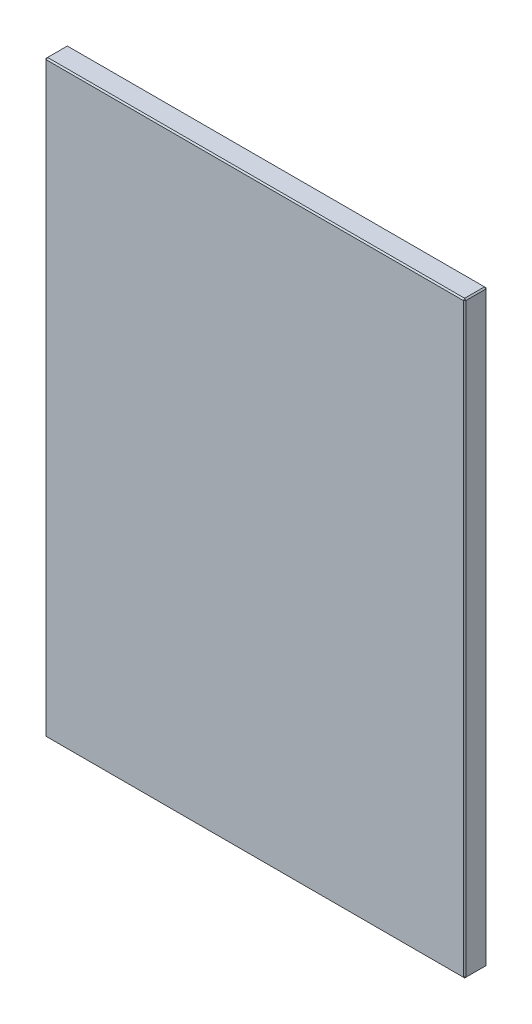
ISO-10303-21;
HEADER;
FILE_DESCRIPTION(('STEP AP214'),'2;1');
FILE_NAME('part.step','',(''),(''),'','','');
FILE_SCHEMA(('AUTOMOTIVE_DESIGN { 1 0 10303 214 1 1 1 1 }'));
ENDSEC;
DATA;
#1=APPLICATION_CONTEXT('core data for automotive mechanical design processes');
#2=APPLICATION_PROTOCOL_DEFINITION('international standard','automotive_design',2000,#1);
#3=PRODUCT_CONTEXT('',#1,'mechanical');
#4=PRODUCT('Part','Part','',(#3));
#5=PRODUCT_RELATED_PRODUCT_CATEGORY('part','',(#4));
#6=PRODUCT_DEFINITION_FORMATION('','',#4);
#7=PRODUCT_DEFINITION_CONTEXT('part definition',#1,'design');
#8=PRODUCT_DEFINITION('design','',#6,#7);
#9=PRODUCT_DEFINITION_SHAPE('','',#8);
#10=(LENGTH_UNIT() NAMED_UNIT(*) SI_UNIT(.MILLI.,.METRE.));
#11=(NAMED_UNIT(*) PLANE_ANGLE_UNIT() SI_UNIT($,.RADIAN.));
#12=(NAMED_UNIT(*) SI_UNIT($,.STERADIAN.) SOLID_ANGLE_UNIT());
#13=UNCERTAINTY_MEASURE_WITH_UNIT(LENGTH_MEASURE(1.E-05),#10,'distance_accuracy_value','');
#14=(GEOMETRIC_REPRESENTATION_CONTEXT(3) GLOBAL_UNCERTAINTY_ASSIGNED_CONTEXT((#13)) GLOBAL_UNIT_ASSIGNED_CONTEXT((#10,
#11,#12)) REPRESENTATION_CONTEXT('',''));
#15=CARTESIAN_POINT('',(0.,0.,0.));
#16=DIRECTION('',(0.,0.,1.));
#17=DIRECTION('',(1.,0.,0.));
#18=AXIS2_PLACEMENT_3D('',#15,#16,#17);
#19=CARTESIAN_POINT('',(-159.,-223.,17.));
#20=DIRECTION('',(1.,0.,0.));
#21=DIRECTION('',(0.,0.,-1.));
#22=AXIS2_PLACEMENT_3D('',#19,#20,#21);
#23=PLANE('',#22);
#24=DIRECTION('',(0.,0.,-1.));
#25=VECTOR('',#24,1.);
#26=CARTESIAN_POINT('',(-159.,222.,17.));
#27=LINE('',#26,#25);
#28=CARTESIAN_POINT('',(-159.,222.,16.));
#29=VERTEX_POINT('',#28);
#30=CARTESIAN_POINT('',(-159.,222.,1.));
#31=VERTEX_POINT('',#30);
#32=EDGE_CURVE('E114',#29,#31,#27,.T.);
#33=ORIENTED_EDGE('',*,*,#32,.T.);
#34=DIRECTION('',(0.,-1.,0.));
#35=VECTOR('',#34,1.);
#36=CARTESIAN_POINT('',(-159.,-223.,1.));
#37=LINE('',#36,#35);
#38=CARTESIAN_POINT('',(-159.,-222.,1.));
#39=VERTEX_POINT('',#38);
#40=EDGE_CURVE('E110',#31,#39,#37,.T.);
#41=ORIENTED_EDGE('',*,*,#40,.T.);
#42=DIRECTION('',(0.,0.,1.));
#43=VECTOR('',#42,1.);
#44=CARTESIAN_POINT('',(-159.,-222.,17.));
#45=LINE('',#44,#43);
#46=CARTESIAN_POINT('',(-159.,-222.,16.));
#47=VERTEX_POINT('',#46);
#48=EDGE_CURVE('E103',#39,#47,#45,.T.);
#49=ORIENTED_EDGE('',*,*,#48,.T.);
#50=DIRECTION('',(0.,1.,0.));
#51=VECTOR('',#50,1.);
#52=CARTESIAN_POINT('',(-159.,223.,16.));
#53=LINE('',#52,#51);
#54=EDGE_CURVE('E107',#47,#29,#53,.T.);
#55=ORIENTED_EDGE('',*,*,#54,.T.);
#56=EDGE_LOOP('',(#33,#41,#49,#55));
#57=FACE_BOUND('',#56,.T.);
#58=ADVANCED_FACE('F15',(#57),#23,.F.);
#59=CARTESIAN_POINT('',(159.,-223.,17.));
#60=DIRECTION('',(0.,1.,0.));
#61=DIRECTION('',(-1.,0.,0.));
#62=AXIS2_PLACEMENT_3D('',#59,#60,#61);
#63=PLANE('',#62);
#64=DIRECTION('',(0.,0.,-1.));
#65=VECTOR('',#64,1.);
#66=CARTESIAN_POINT('',(-158.,-223.,17.));
#67=LINE('',#66,#65);
#68=CARTESIAN_POINT('',(-158.,-223.,16.));
#69=VERTEX_POINT('',#68);
#70=CARTESIAN_POINT('',(-158.,-223.,1.00000000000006));
#71=VERTEX_POINT('',#70);
#72=EDGE_CURVE('E122',#69,#71,#67,.T.);
#73=ORIENTED_EDGE('',*,*,#72,.T.);
#74=DIRECTION('',(1.,0.,0.));
#75=VECTOR('',#74,1.);
#76=CARTESIAN_POINT('',(159.,-223.,1.00000000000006));
#77=LINE('',#76,#75);
#78=CARTESIAN_POINT('',(158.,-223.,1.00000000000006));
#79=VERTEX_POINT('',#78);
#80=EDGE_CURVE('E160',#71,#79,#77,.T.);
#81=ORIENTED_EDGE('',*,*,#80,.T.);
#82=DIRECTION('',(0.,0.,1.));
#83=VECTOR('',#82,1.);
#84=CARTESIAN_POINT('',(158.,-223.,17.));
#85=LINE('',#84,#83);
#86=CARTESIAN_POINT('',(158.,-223.,16.));
#87=VERTEX_POINT('',#86);
#88=EDGE_CURVE('E157',#79,#87,#85,.T.);
#89=ORIENTED_EDGE('',*,*,#88,.T.);
#90=DIRECTION('',(-1.,0.,0.));
#91=VECTOR('',#90,1.);
#92=CARTESIAN_POINT('',(-159.,-223.,16.));
#93=LINE('',#92,#91);
#94=EDGE_CURVE('E155',#87,#69,#93,.T.);
#95=ORIENTED_EDGE('',*,*,#94,.T.);
#96=EDGE_LOOP('',(#73,#81,#89,#95));
#97=FACE_BOUND('',#96,.T.);
#98=ADVANCED_FACE('F277',(#97),#63,.F.);
#99=CARTESIAN_POINT('',(159.,-223.,17.));
#100=DIRECTION('',(-1.,0.,0.));
#101=DIRECTION('',(0.,0.,1.));
#102=AXIS2_PLACEMENT_3D('',#99,#100,#101);
#103=PLANE('',#102);
#104=DIRECTION('',(0.,-1.,0.));
#105=VECTOR('',#104,1.);
#106=CARTESIAN_POINT('',(159.,-223.,16.));
#107=LINE('',#106,#105);
#108=CARTESIAN_POINT('',(159.,222.,16.));
#109=VERTEX_POINT('',#108);
#110=CARTESIAN_POINT('',(159.,-222.,16.));
#111=VERTEX_POINT('',#110);
#112=EDGE_CURVE('E162',#109,#111,#107,.T.);
#113=ORIENTED_EDGE('',*,*,#112,.T.);
#114=DIRECTION('',(0.,0.,-1.));
#115=VECTOR('',#114,1.);
#116=CARTESIAN_POINT('',(159.,-222.,17.));
#117=LINE('',#116,#115);
#118=CARTESIAN_POINT('',(159.,-222.,1.00000000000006));
#119=VERTEX_POINT('',#118);
#120=EDGE_CURVE('E168',#111,#119,#117,.T.);
#121=ORIENTED_EDGE('',*,*,#120,.T.);
#122=DIRECTION('',(0.,1.,0.));
#123=VECTOR('',#122,1.);
#124=CARTESIAN_POINT('',(159.,-223.,1.00000000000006));
#125=LINE('',#124,#123);
#126=CARTESIAN_POINT('',(159.,222.,1.00000000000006));
#127=VERTEX_POINT('',#126);
#128=EDGE_CURVE('E166',#119,#127,#125,.T.);
#129=ORIENTED_EDGE('',*,*,#128,.T.);
#130=DIRECTION('',(0.,0.,1.));
#131=VECTOR('',#130,1.);
#132=CARTESIAN_POINT('',(159.,222.,17.));
#133=LINE('',#132,#131);
#134=EDGE_CURVE('E164',#127,#109,#133,.T.);
#135=ORIENTED_EDGE('',*,*,#134,.T.);
#136=EDGE_LOOP('',(#113,#121,#129,#135));
#137=FACE_BOUND('',#136,.T.);
#138=ADVANCED_FACE('F254',(#137),#103,.F.);
#139=CARTESIAN_POINT('',(159.,223.,17.));
#140=DIRECTION('',(0.,-1.,0.));
#141=DIRECTION('',(1.,0.,0.));
#142=AXIS2_PLACEMENT_3D('',#139,#140,#141);
#143=PLANE('',#142);
#144=DIRECTION('',(-1.,0.,0.));
#145=VECTOR('',#144,1.);
#146=CARTESIAN_POINT('',(159.,223.,1.00000000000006));
#147=LINE('',#146,#145);
#148=CARTESIAN_POINT('',(158.,223.,1.00000000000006));
#149=VERTEX_POINT('',#148);
#150=CARTESIAN_POINT('',(-158.,223.,1.00000000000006));
#151=VERTEX_POINT('',#150);
#152=EDGE_CURVE('E150',#149,#151,#147,.T.);
#153=ORIENTED_EDGE('',*,*,#152,.T.);
#154=DIRECTION('',(0.,0.,1.));
#155=VECTOR('',#154,1.);
#156=CARTESIAN_POINT('',(-158.,223.,17.));
#157=LINE('',#156,#155);
#158=CARTESIAN_POINT('',(-158.,223.,16.));
#159=VERTEX_POINT('',#158);
#160=EDGE_CURVE('E152',#151,#159,#157,.T.);
#161=ORIENTED_EDGE('',*,*,#160,.T.);
#162=DIRECTION('',(1.,0.,0.));
#163=VECTOR('',#162,1.);
#164=CARTESIAN_POINT('',(159.,223.,16.));
#165=LINE('',#164,#163);
#166=CARTESIAN_POINT('',(158.,223.,16.));
#167=VERTEX_POINT('',#166);
#168=EDGE_CURVE('E146',#159,#167,#165,.T.);
#169=ORIENTED_EDGE('',*,*,#168,.T.);
#170=DIRECTION('',(0.,0.,-1.));
#171=VECTOR('',#170,1.);
#172=CARTESIAN_POINT('',(158.,223.,17.));
#173=LINE('',#172,#171);
#174=EDGE_CURVE('E148',#167,#149,#173,.T.);
#175=ORIENTED_EDGE('',*,*,#174,.T.);
#176=EDGE_LOOP('',(#153,#161,#169,#175));
#177=FACE_BOUND('',#176,.T.);
#178=ADVANCED_FACE('F286',(#177),#143,.F.);
#179=CARTESIAN_POINT('',(0.,0.,17.));
#180=DIRECTION('',(0.,0.,1.));
#181=DIRECTION('',(1.,0.,0.));
#182=AXIS2_PLACEMENT_3D('',#179,#180,#181);
#183=PLANE('',#182);
#184=DIRECTION('',(0.,1.,0.));
#185=VECTOR('',#184,1.);
#186=CARTESIAN_POINT('',(158.,223.,17.));
#187=LINE('',#186,#185);
#188=CARTESIAN_POINT('',(158.,-222.,17.));
#189=VERTEX_POINT('',#188);
#190=CARTESIAN_POINT('',(158.,222.,17.));
#191=VERTEX_POINT('',#190);
#192=EDGE_CURVE('E24',#189,#191,#187,.T.);
#193=ORIENTED_EDGE('',*,*,#192,.T.);
#194=DIRECTION('',(-1.,0.,0.));
#195=VECTOR('',#194,1.);
#196=CARTESIAN_POINT('',(-159.,222.,17.));
#197=LINE('',#196,#195);
#198=CARTESIAN_POINT('',(-158.,222.,17.));
#199=VERTEX_POINT('',#198);
#200=EDGE_CURVE('E9',#191,#199,#197,.T.);
#201=ORIENTED_EDGE('',*,*,#200,.T.);
#202=DIRECTION('',(0.,-1.,0.));
#203=VECTOR('',#202,1.);
#204=CARTESIAN_POINT('',(-158.,-223.,17.));
#205=LINE('',#204,#203);
#206=CARTESIAN_POINT('',(-158.,-222.,17.));
#207=VERTEX_POINT('',#206);
#208=EDGE_CURVE('E180',#199,#207,#205,.T.);
#209=ORIENTED_EDGE('',*,*,#208,.T.);
#210=DIRECTION('',(1.,0.,0.));
#211=VECTOR('',#210,1.);
#212=CARTESIAN_POINT('',(159.,-222.,17.));
#213=LINE('',#212,#211);
#214=EDGE_CURVE('E35',#207,#189,#213,.T.);
#215=ORIENTED_EDGE('',*,*,#214,.T.);
#216=EDGE_LOOP('',(#193,#201,#209,#215));
#217=FACE_BOUND('',#216,.T.);
#218=ADVANCED_FACE('F351',(#217),#183,.T.);
#219=CARTESIAN_POINT('',(0.,0.,0.));
#220=DIRECTION('',(0.,0.,1.));
#221=DIRECTION('',(1.,0.,0.));
#222=AXIS2_PLACEMENT_3D('',#219,#220,#221);
#223=PLANE('',#222);
#224=DIRECTION('',(0.,-1.,0.));
#225=VECTOR('',#224,1.);
#226=CARTESIAN_POINT('',(158.,0.,0.));
#227=LINE('',#226,#225);
#228=CARTESIAN_POINT('',(158.,222.,0.));
#229=VERTEX_POINT('',#228);
#230=CARTESIAN_POINT('',(158.,-222.,0.));
#231=VERTEX_POINT('',#230);
#232=EDGE_CURVE('E175',#229,#231,#227,.T.);
#233=ORIENTED_EDGE('',*,*,#232,.T.);
#234=DIRECTION('',(-1.,0.,0.));
#235=VECTOR('',#234,1.);
#236=CARTESIAN_POINT('',(0.,-222.,0.));
#237=LINE('',#236,#235);
#238=CARTESIAN_POINT('',(-158.,-222.,0.));
#239=VERTEX_POINT('',#238);
#240=EDGE_CURVE('E177',#231,#239,#237,.T.);
#241=ORIENTED_EDGE('',*,*,#240,.T.);
#242=DIRECTION('',(0.,1.,0.));
#243=VECTOR('',#242,1.);
#244=CARTESIAN_POINT('',(-158.,0.,0.));
#245=LINE('',#244,#243);
#246=CARTESIAN_POINT('',(-158.,222.,0.));
#247=VERTEX_POINT('',#246);
#248=EDGE_CURVE('E173',#239,#247,#245,.T.);
#249=ORIENTED_EDGE('',*,*,#248,.T.);
#250=DIRECTION('',(1.,0.,0.));
#251=VECTOR('',#250,1.);
#252=CARTESIAN_POINT('',(0.,222.,0.));
#253=LINE('',#252,#251);
#254=EDGE_CURVE('E171',#247,#229,#253,.T.);
#255=ORIENTED_EDGE('',*,*,#254,.T.);
#256=EDGE_LOOP('',(#233,#241,#249,#255));
#257=FACE_BOUND('',#256,.T.);
#258=ADVANCED_FACE('F246',(#257),#223,.F.);
#259=CARTESIAN_POINT('',(159.,-222.,17.));
#260=DIRECTION('',(-0.707106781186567,0.707106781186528,0.));
#261=DIRECTION('',(0.,0.,-1.));
#262=AXIS2_PLACEMENT_3D('',#259,#260,#261);
#263=PLANE('',#262);
#264=DIRECTION('',(-0.707106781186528,-0.707106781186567,0.));
#265=VECTOR('',#264,1.);
#266=CARTESIAN_POINT('',(158.,-223.,16.));
#267=LINE('',#266,#265);
#268=EDGE_CURVE('E19',#87,#111,#267,.F.);
#269=ORIENTED_EDGE('',*,*,#268,.F.);
#270=ORIENTED_EDGE('',*,*,#88,.F.);
#271=DIRECTION('',(0.707106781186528,0.707106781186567,0.));
#272=VECTOR('',#271,1.);
#273=CARTESIAN_POINT('',(159.,-222.,1.00000000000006));
#274=LINE('',#273,#272);
#275=EDGE_CURVE('E142',#119,#79,#274,.F.);
#276=ORIENTED_EDGE('',*,*,#275,.F.);
#277=ORIENTED_EDGE('',*,*,#120,.F.);
#278=EDGE_LOOP('',(#269,#270,#276,#277));
#279=FACE_BOUND('',#278,.T.);
#280=ADVANCED_FACE('F17',(#279),#263,.F.);
#281=CARTESIAN_POINT('',(158.,-223.,16.));
#282=DIRECTION('',(0.577350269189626,-0.577350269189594,0.577350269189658));
#283=DIRECTION('',(0.707106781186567,0.,-0.707106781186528));
#284=AXIS2_PLACEMENT_3D('',#281,#282,#283);
#285=PLANE('',#284);
#286=DIRECTION('',(0.,-0.707106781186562,-0.707106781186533));
#287=VECTOR('',#286,1.);
#288=CARTESIAN_POINT('',(158.,-223.,16.));
#289=LINE('',#288,#287);
#290=EDGE_CURVE('E227',#87,#189,#289,.F.);
#291=ORIENTED_EDGE('',*,*,#290,.F.);
#292=ORIENTED_EDGE('',*,*,#268,.T.);
#293=DIRECTION('',(-0.707106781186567,0.,0.707106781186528));
#294=VECTOR('',#293,1.);
#295=CARTESIAN_POINT('',(158.5,-222.,16.5));
#296=LINE('',#295,#294);
#297=EDGE_CURVE('E229',#189,#111,#296,.F.);
#298=ORIENTED_EDGE('',*,*,#297,.F.);
#299=EDGE_LOOP('',(#291,#292,#298));
#300=FACE_BOUND('',#299,.T.);
#301=ADVANCED_FACE('F272',(#300),#285,.T.);
#302=CARTESIAN_POINT('',(159.,-222.,1.00000000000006));
#303=DIRECTION('',(0.577350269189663,-0.577350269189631,-0.577350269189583));
#304=DIRECTION('',(0.707106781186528,0.707106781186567,0.));
#305=AXIS2_PLACEMENT_3D('',#302,#303,#304);
#306=PLANE('',#305);
#307=DIRECTION('',(-0.707106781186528,0.,-0.707106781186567));
#308=VECTOR('',#307,1.);
#309=CARTESIAN_POINT('',(159.,-222.,1.00000000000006));
#310=LINE('',#309,#308);
#311=EDGE_CURVE('E221',#119,#231,#310,.T.);
#312=ORIENTED_EDGE('',*,*,#311,.F.);
#313=ORIENTED_EDGE('',*,*,#275,.T.);
#314=DIRECTION('',(0.,-0.707106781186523,0.707106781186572));
#315=VECTOR('',#314,1.);
#316=CARTESIAN_POINT('',(158.,-222.5,0.500000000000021));
#317=LINE('',#316,#315);
#318=EDGE_CURVE('E224',#231,#79,#317,.T.);
#319=ORIENTED_EDGE('',*,*,#318,.F.);
#320=EDGE_LOOP('',(#312,#313,#319));
#321=FACE_BOUND('',#320,.T.);
#322=ADVANCED_FACE('F236',(#321),#306,.T.);
#323=CARTESIAN_POINT('',(158.,0.,17.));
#324=DIRECTION('',(0.707106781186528,0.,0.707106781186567));
#325=DIRECTION('',(0.,-1.,0.));
#326=AXIS2_PLACEMENT_3D('',#323,#324,#325);
#327=PLANE('',#326);
#328=ORIENTED_EDGE('',*,*,#297,.T.);
#329=ORIENTED_EDGE('',*,*,#112,.F.);
#330=DIRECTION('',(0.707106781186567,0.,-0.707106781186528));
#331=VECTOR('',#330,1.);
#332=CARTESIAN_POINT('',(159.,222.,16.));
#333=LINE('',#332,#331);
#334=EDGE_CURVE('E215',#191,#109,#333,.T.);
#335=ORIENTED_EDGE('',*,*,#334,.F.);
#336=ORIENTED_EDGE('',*,*,#192,.F.);
#337=EDGE_LOOP('',(#328,#329,#335,#336));
#338=FACE_BOUND('',#337,.T.);
#339=ADVANCED_FACE('F267',(#338),#327,.T.);
#340=CARTESIAN_POINT('',(0.,-222.,17.));
#341=DIRECTION('',(0.,-0.707106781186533,0.707106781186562));
#342=DIRECTION('',(-1.,0.,0.));
#343=AXIS2_PLACEMENT_3D('',#340,#341,#342);
#344=PLANE('',#343);
#345=ORIENTED_EDGE('',*,*,#290,.T.);
#346=ORIENTED_EDGE('',*,*,#214,.F.);
#347=DIRECTION('',(0.,0.707106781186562,0.707106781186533));
#348=VECTOR('',#347,1.);
#349=CARTESIAN_POINT('',(-158.,-222.5,16.5));
#350=LINE('',#349,#348);
#351=EDGE_CURVE('E126',#69,#207,#350,.T.);
#352=ORIENTED_EDGE('',*,*,#351,.F.);
#353=ORIENTED_EDGE('',*,*,#94,.F.);
#354=EDGE_LOOP('',(#345,#346,#352,#353));
#355=FACE_BOUND('',#354,.T.);
#356=ADVANCED_FACE('F275',(#355),#344,.T.);
#357=CARTESIAN_POINT('',(-158.,-223.,17.));
#358=DIRECTION('',(0.707106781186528,0.707106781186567,0.));
#359=DIRECTION('',(0.,0.,-1.));
#360=AXIS2_PLACEMENT_3D('',#357,#358,#359);
#361=PLANE('',#360);
#362=DIRECTION('',(0.707106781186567,-0.707106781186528,0.));
#363=VECTOR('',#362,1.);
#364=CARTESIAN_POINT('',(-158.,-223.,1.00000000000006));
#365=LINE('',#364,#363);
#366=EDGE_CURVE('E127',#71,#39,#365,.F.);
#367=ORIENTED_EDGE('',*,*,#366,.F.);
#368=ORIENTED_EDGE('',*,*,#72,.F.);
#369=DIRECTION('',(-0.707106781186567,0.707106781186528,0.));
#370=VECTOR('',#369,1.);
#371=CARTESIAN_POINT('',(-159.,-222.,16.));
#372=LINE('',#371,#370);
#373=EDGE_CURVE('E118',#47,#69,#372,.F.);
#374=ORIENTED_EDGE('',*,*,#373,.F.);
#375=ORIENTED_EDGE('',*,*,#48,.F.);
#376=EDGE_LOOP('',(#367,#368,#374,#375));
#377=FACE_BOUND('',#376,.T.);
#378=ADVANCED_FACE('F120',(#377),#361,.F.);
#379=CARTESIAN_POINT('',(159.,-223.,1.00000000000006));
#380=DIRECTION('',(0.,0.707106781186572,0.707106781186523));
#381=DIRECTION('',(1.,0.,0.));
#382=AXIS2_PLACEMENT_3D('',#379,#380,#381);
#383=PLANE('',#382);
#384=ORIENTED_EDGE('',*,*,#318,.T.);
#385=ORIENTED_EDGE('',*,*,#80,.F.);
#386=DIRECTION('',(0.,0.707106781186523,-0.707106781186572));
#387=VECTOR('',#386,1.);
#388=CARTESIAN_POINT('',(-158.,-223.,1.00000000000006));
#389=LINE('',#388,#387);
#390=EDGE_CURVE('E211',#239,#71,#389,.F.);
#391=ORIENTED_EDGE('',*,*,#390,.F.);
#392=ORIENTED_EDGE('',*,*,#240,.F.);
#393=EDGE_LOOP('',(#384,#385,#391,#392));
#394=FACE_BOUND('',#393,.T.);
#395=ADVANCED_FACE('F243',(#394),#383,.F.);
#396=CARTESIAN_POINT('',(159.,-223.,1.00000000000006));
#397=DIRECTION('',(-0.707106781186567,0.,0.707106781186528));
#398=DIRECTION('',(0.,1.,0.));
#399=AXIS2_PLACEMENT_3D('',#396,#397,#398);
#400=PLANE('',#399);
#401=ORIENTED_EDGE('',*,*,#311,.T.);
#402=ORIENTED_EDGE('',*,*,#232,.F.);
#403=DIRECTION('',(0.707106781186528,0.,0.707106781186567));
#404=VECTOR('',#403,1.);
#405=CARTESIAN_POINT('',(159.,222.,1.00000000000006));
#406=LINE('',#405,#404);
#407=EDGE_CURVE('E208',#127,#229,#406,.F.);
#408=ORIENTED_EDGE('',*,*,#407,.F.);
#409=ORIENTED_EDGE('',*,*,#128,.F.);
#410=EDGE_LOOP('',(#401,#402,#408,#409));
#411=FACE_BOUND('',#410,.T.);
#412=ADVANCED_FACE('F251',(#411),#400,.F.);
#413=CARTESIAN_POINT('',(158.,223.,17.));
#414=DIRECTION('',(-0.707106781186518,-0.707106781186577,0.));
#415=DIRECTION('',(0.,0.,-1.));
#416=AXIS2_PLACEMENT_3D('',#413,#414,#415);
#417=PLANE('',#416);
#418=DIRECTION('',(0.707106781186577,-0.707106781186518,0.));
#419=VECTOR('',#418,1.);
#420=CARTESIAN_POINT('',(159.,222.,16.));
#421=LINE('',#420,#419);
#422=EDGE_CURVE('E218',#109,#167,#421,.F.);
#423=ORIENTED_EDGE('',*,*,#422,.F.);
#424=ORIENTED_EDGE('',*,*,#134,.F.);
#425=DIRECTION('',(-0.707106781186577,0.707106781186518,0.));
#426=VECTOR('',#425,1.);
#427=CARTESIAN_POINT('',(159.,222.,1.00000000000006));
#428=LINE('',#427,#426);
#429=EDGE_CURVE('E205',#149,#127,#428,.F.);
#430=ORIENTED_EDGE('',*,*,#429,.F.);
#431=ORIENTED_EDGE('',*,*,#174,.F.);
#432=EDGE_LOOP('',(#423,#424,#430,#431));
#433=FACE_BOUND('',#432,.T.);
#434=ADVANCED_FACE('F259',(#433),#417,.F.);
#435=CARTESIAN_POINT('',(159.,222.,16.));
#436=DIRECTION('',(0.577350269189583,0.577350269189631,0.577350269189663));
#437=DIRECTION('',(0.,-0.707106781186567,0.707106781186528));
#438=AXIS2_PLACEMENT_3D('',#435,#436,#437);
#439=PLANE('',#438);
#440=ORIENTED_EDGE('',*,*,#334,.T.);
#441=ORIENTED_EDGE('',*,*,#422,.T.);
#442=DIRECTION('',(0.,-0.707106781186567,0.707106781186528));
#443=VECTOR('',#442,1.);
#444=CARTESIAN_POINT('',(158.,222.5,16.5));
#445=LINE('',#444,#443);
#446=EDGE_CURVE('E134',#191,#167,#445,.F.);
#447=ORIENTED_EDGE('',*,*,#446,.F.);
#448=EDGE_LOOP('',(#440,#441,#447));
#449=FACE_BOUND('',#448,.T.);
#450=ADVANCED_FACE('F264',(#449),#439,.T.);
#451=CARTESIAN_POINT('',(-159.,-222.,16.));
#452=DIRECTION('',(-0.577350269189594,-0.577350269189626,0.577350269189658));
#453=DIRECTION('',(0.,-0.707106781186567,-0.707106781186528));
#454=AXIS2_PLACEMENT_3D('',#451,#452,#453);
#455=PLANE('',#454);
#456=ORIENTED_EDGE('',*,*,#373,.T.);
#457=ORIENTED_EDGE('',*,*,#351,.T.);
#458=DIRECTION('',(-0.707106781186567,0.,-0.707106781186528));
#459=VECTOR('',#458,1.);
#460=CARTESIAN_POINT('',(-159.,-222.,16.));
#461=LINE('',#460,#459);
#462=EDGE_CURVE('E130',#47,#207,#461,.F.);
#463=ORIENTED_EDGE('',*,*,#462,.F.);
#464=EDGE_LOOP('',(#456,#457,#463));
#465=FACE_BOUND('',#464,.T.);
#466=ADVANCED_FACE('F131',(#465),#455,.T.);
#467=CARTESIAN_POINT('',(-158.,-223.,1.00000000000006));
#468=DIRECTION('',(-0.577350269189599,-0.577350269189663,-0.577350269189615));
#469=DIRECTION('',(0.,0.707106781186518,-0.707106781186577));
#470=AXIS2_PLACEMENT_3D('',#467,#468,#469);
#471=PLANE('',#470);
#472=ORIENTED_EDGE('',*,*,#390,.T.);
#473=ORIENTED_EDGE('',*,*,#366,.T.);
#474=DIRECTION('',(-0.707106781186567,0.,0.707106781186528));
#475=VECTOR('',#474,1.);
#476=CARTESIAN_POINT('',(-158.5,-222.,0.499999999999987));
#477=LINE('',#476,#475);
#478=EDGE_CURVE('E135',#239,#39,#477,.T.);
#479=ORIENTED_EDGE('',*,*,#478,.F.);
#480=EDGE_LOOP('',(#472,#473,#479));
#481=FACE_BOUND('',#480,.T.);
#482=ADVANCED_FACE('F320',(#481),#471,.T.);
#483=CARTESIAN_POINT('',(159.,222.,1.00000000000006));
#484=DIRECTION('',(0.577350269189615,0.577350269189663,-0.577350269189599));
#485=DIRECTION('',(-0.707106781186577,0.707106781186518,0.));
#486=AXIS2_PLACEMENT_3D('',#483,#484,#485);
#487=PLANE('',#486);
#488=ORIENTED_EDGE('',*,*,#429,.T.);
#489=ORIENTED_EDGE('',*,*,#407,.T.);
#490=DIRECTION('',(0.,-0.707106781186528,-0.707106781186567));
#491=VECTOR('',#490,1.);
#492=CARTESIAN_POINT('',(158.,222.5,0.500000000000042));
#493=LINE('',#492,#491);
#494=EDGE_CURVE('E198',#149,#229,#493,.T.);
#495=ORIENTED_EDGE('',*,*,#494,.F.);
#496=EDGE_LOOP('',(#488,#489,#495));
#497=FACE_BOUND('',#496,.T.);
#498=ADVANCED_FACE('F316',(#497),#487,.T.);
#499=CARTESIAN_POINT('',(0.,222.,17.));
#500=DIRECTION('',(0.,0.707106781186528,0.707106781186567));
#501=DIRECTION('',(1.,0.,0.));
#502=AXIS2_PLACEMENT_3D('',#499,#500,#501);
#503=PLANE('',#502);
#504=ORIENTED_EDGE('',*,*,#446,.T.);
#505=ORIENTED_EDGE('',*,*,#168,.F.);
#506=DIRECTION('',(0.,0.707106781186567,-0.707106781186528));
#507=VECTOR('',#506,1.);
#508=CARTESIAN_POINT('',(-158.,223.,16.));
#509=LINE('',#508,#507);
#510=EDGE_CURVE('E195',#199,#159,#509,.T.);
#511=ORIENTED_EDGE('',*,*,#510,.F.);
#512=ORIENTED_EDGE('',*,*,#200,.F.);
#513=EDGE_LOOP('',(#504,#505,#511,#512));
#514=FACE_BOUND('',#513,.T.);
#515=ADVANCED_FACE('F313',(#514),#503,.T.);
#516=CARTESIAN_POINT('',(-158.,0.,17.));
#517=DIRECTION('',(-0.707106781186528,0.,0.707106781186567));
#518=DIRECTION('',(0.,1.,0.));
#519=AXIS2_PLACEMENT_3D('',#516,#517,#518);
#520=PLANE('',#519);
#521=ORIENTED_EDGE('',*,*,#462,.T.);
#522=ORIENTED_EDGE('',*,*,#208,.F.);
#523=DIRECTION('',(0.707106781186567,0.,0.707106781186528));
#524=VECTOR('',#523,1.);
#525=CARTESIAN_POINT('',(-158.5,222.,16.5));
#526=LINE('',#525,#524);
#527=EDGE_CURVE('E138',#29,#199,#526,.T.);
#528=ORIENTED_EDGE('',*,*,#527,.F.);
#529=ORIENTED_EDGE('',*,*,#54,.F.);
#530=EDGE_LOOP('',(#521,#522,#528,#529));
#531=FACE_BOUND('',#530,.T.);
#532=ADVANCED_FACE('F137',(#531),#520,.T.);
#533=CARTESIAN_POINT('',(-159.,-223.,1.));
#534=DIRECTION('',(0.707106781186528,0.,0.707106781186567));
#535=DIRECTION('',(0.,-1.,0.));
#536=AXIS2_PLACEMENT_3D('',#533,#534,#535);
#537=PLANE('',#536);
#538=ORIENTED_EDGE('',*,*,#478,.T.);
#539=ORIENTED_EDGE('',*,*,#40,.F.);
#540=DIRECTION('',(0.707106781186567,0.,-0.707106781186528));
#541=VECTOR('',#540,1.);
#542=CARTESIAN_POINT('',(-159.,222.,1.));
#543=LINE('',#542,#541);
#544=EDGE_CURVE('E191',#247,#31,#543,.F.);
#545=ORIENTED_EDGE('',*,*,#544,.F.);
#546=ORIENTED_EDGE('',*,*,#248,.F.);
#547=EDGE_LOOP('',(#538,#539,#545,#546));
#548=FACE_BOUND('',#547,.T.);
#549=ADVANCED_FACE('F306',(#548),#537,.F.);
#550=CARTESIAN_POINT('',(159.,223.,1.00000000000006));
#551=DIRECTION('',(0.,-0.707106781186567,0.707106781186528));
#552=DIRECTION('',(-1.,0.,0.));
#553=AXIS2_PLACEMENT_3D('',#550,#551,#552);
#554=PLANE('',#553);
#555=ORIENTED_EDGE('',*,*,#494,.T.);
#556=ORIENTED_EDGE('',*,*,#254,.F.);
#557=DIRECTION('',(0.,0.707106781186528,0.707106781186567));
#558=VECTOR('',#557,1.);
#559=CARTESIAN_POINT('',(-158.,222.5,0.500000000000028));
#560=LINE('',#559,#558);
#561=EDGE_CURVE('E188',#151,#247,#560,.F.);
#562=ORIENTED_EDGE('',*,*,#561,.F.);
#563=ORIENTED_EDGE('',*,*,#152,.F.);
#564=EDGE_LOOP('',(#555,#556,#562,#563));
#565=FACE_BOUND('',#564,.T.);
#566=ADVANCED_FACE('F302',(#565),#554,.F.);
#567=CARTESIAN_POINT('',(-158.,223.,16.));
#568=DIRECTION('',(-0.577350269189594,0.577350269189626,0.577350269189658));
#569=DIRECTION('',(0.,-0.707106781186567,0.707106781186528));
#570=AXIS2_PLACEMENT_3D('',#567,#568,#569);
#571=PLANE('',#570);
#572=ORIENTED_EDGE('',*,*,#527,.T.);
#573=ORIENTED_EDGE('',*,*,#510,.T.);
#574=DIRECTION('',(0.707106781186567,0.707106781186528,0.));
#575=VECTOR('',#574,1.);
#576=CARTESIAN_POINT('',(-158.,223.,16.));
#577=LINE('',#576,#575);
#578=EDGE_CURVE('E186',#29,#159,#577,.T.);
#579=ORIENTED_EDGE('',*,*,#578,.F.);
#580=EDGE_LOOP('',(#572,#573,#579));
#581=FACE_BOUND('',#580,.T.);
#582=ADVANCED_FACE('F298',(#581),#571,.T.);
#583=CARTESIAN_POINT('',(-159.,222.,1.));
#584=DIRECTION('',(-0.577350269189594,0.577350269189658,-0.577350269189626));
#585=DIRECTION('',(0.,0.707106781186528,0.707106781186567));
#586=AXIS2_PLACEMENT_3D('',#583,#584,#585);
#587=PLANE('',#586);
#588=ORIENTED_EDGE('',*,*,#561,.T.);
#589=ORIENTED_EDGE('',*,*,#544,.T.);
#590=DIRECTION('',(-0.707106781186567,-0.707106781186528,0.));
#591=VECTOR('',#590,1.);
#592=CARTESIAN_POINT('',(-159.,222.,1.));
#593=LINE('',#592,#591);
#594=EDGE_CURVE('E184',#151,#31,#593,.T.);
#595=ORIENTED_EDGE('',*,*,#594,.F.);
#596=EDGE_LOOP('',(#588,#589,#595));
#597=FACE_BOUND('',#596,.T.);
#598=ADVANCED_FACE('F294',(#597),#587,.T.);
#599=CARTESIAN_POINT('',(-159.,222.,17.));
#600=DIRECTION('',(0.707106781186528,-0.707106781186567,0.));
#601=DIRECTION('',(0.,0.,-1.));
#602=AXIS2_PLACEMENT_3D('',#599,#600,#601);
#603=PLANE('',#602);
#604=ORIENTED_EDGE('',*,*,#578,.T.);
#605=ORIENTED_EDGE('',*,*,#160,.F.);
#606=ORIENTED_EDGE('',*,*,#594,.T.);
#607=ORIENTED_EDGE('',*,*,#32,.F.);
#608=EDGE_LOOP('',(#604,#605,#606,#607));
#609=FACE_BOUND('',#608,.T.);
#610=ADVANCED_FACE('F291',(#609),#603,.F.);
#611=CLOSED_SHELL('',(#58,#98,#138,#178,#218,#258,#280,#301,#322,#339,#356,#378,#395,#412,#434,
#450,#466,#482,#498,#515,#532,#549,#566,#582,#598,#610));
#612=MANIFOLD_SOLID_BREP('B1',#611);
#613=ADVANCED_BREP_SHAPE_REPRESENTATION('',(#18,#612),#14);
#614=SHAPE_DEFINITION_REPRESENTATION(#9,#613);
ENDSEC;
END-ISO-10303-21;
